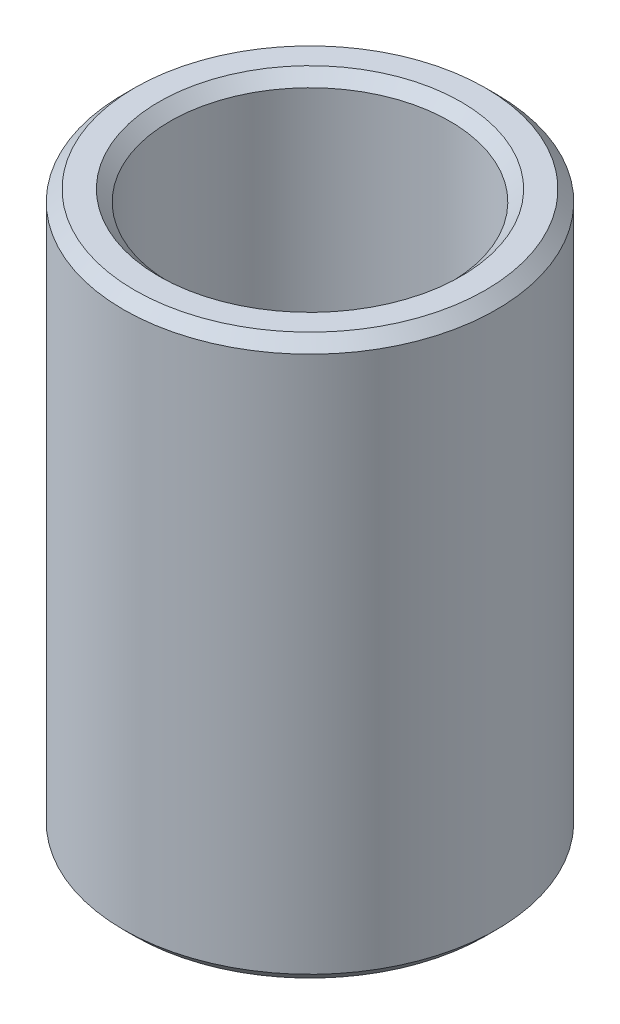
from build123d import *

# Parameters (mm, degrees)
ODIA_R         = 25.40635
LENGTH_DEPTH   = 76.2
IDIA_R         = 19.05635
EXTRUDE1_DEPTH = 85.246099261
CHAMFER1_SIZE  = 1.524


with BuildPart() as part:
    # ODia → Length (new body)
    with BuildSketch(Plane(origin=(0, 0, 0), x_dir=(1, 0, 0), z_dir=(0, 1, 0))):
        with Locations(Location((0, 0, 0), (0, 0, 90))):
            Circle(ODIA_R)
    extrude(amount=LENGTH_DEPTH)

    # IDia → Extrude1 (cut, through all)
    with BuildSketch(Plane.XZ.offset(-76.2)):
        with Locations(Location((0, 0, 0), (0, 0, 90))):
            Circle(IDIA_R)
    extrude(amount=EXTRUDE1_DEPTH, mode=Mode.SUBTRACT)

    # Chamfer1
    chamfer1_edges = [part.edges().sort_by_distance(p)[0] for p in [
        (0, 0, 25.40635),
        (0, 76.2, 25.40635),
        (0, 76.2, -19.05635),
        (0, 0, -19.05635),
    ]]
    chamfer(chamfer1_edges, length=CHAMFER1_SIZE)


solid = part.part
